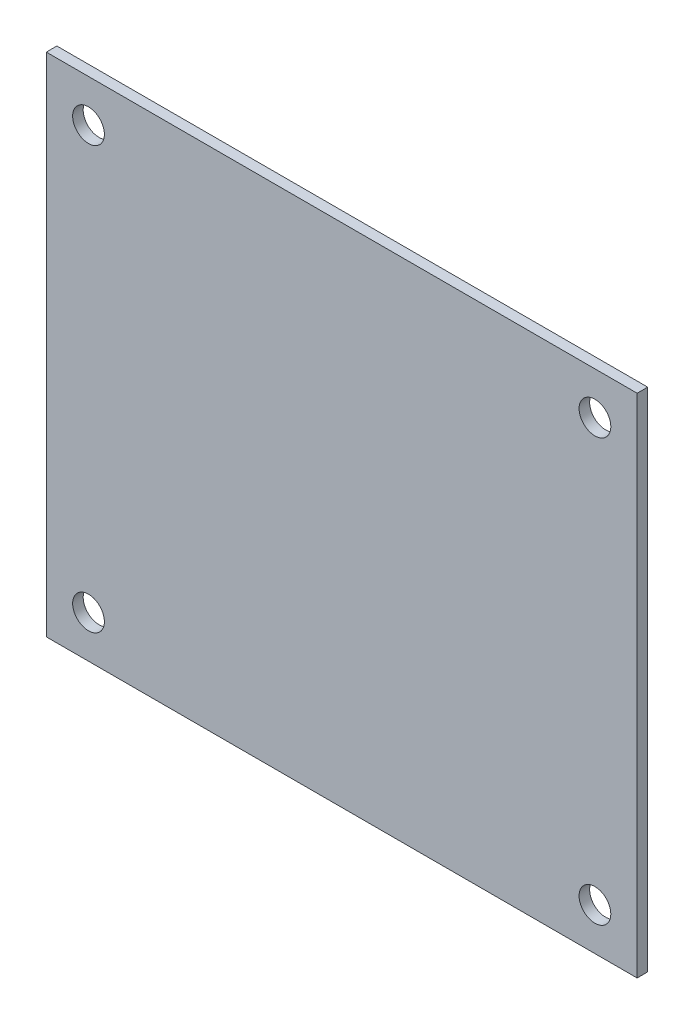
from build123d import *

# Parameters (mm, degrees)
SKETCH1_W           = 88.9
SKETCH1_H           = 76.2
SKETCH1_R           = 2.3876
BOSS_EXTRUDE1_DEPTH = 1.5875
CUT_EXTRUDE1_DEPTH  = 0.127


with BuildPart() as part:
    # Sketch1 → Boss-Extrude1 (new body)
    with BuildSketch(Plane.XY):
        Rectangle(SKETCH1_W, SKETCH1_H)
        with Locations((-38.1, 31.75)):
            Circle(SKETCH1_R, mode=Mode.SUBTRACT)
        with Locations((-38.1, -31.75)):
            Circle(SKETCH1_R, mode=Mode.SUBTRACT)
        with Locations((38.1, -31.75)):
            Circle(SKETCH1_R, mode=Mode.SUBTRACT)
        with Locations((38.1, 31.75)):
            Circle(SKETCH1_R, mode=Mode.SUBTRACT)
    extrude(amount=BOSS_EXTRUDE1_DEPTH)

    # Sketch2 → Cut-Extrude1 (cut)
    # profile 1 of 12: a face of its own
    with BuildSketch(Plane(origin=(0, 0, 0), x_dir=(-1, 0, 0), z_dir=(0, 0, -1))):
        with BuildLine():
            Line((18.503368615, -23.41424052), (18.503368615, -26.58924052))
            Line((18.503368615, -26.58924052), (17.862262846, -26.58924052))
            add(Edge.make_bspline(
                [(17.862262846, -26.58924052), (17.806501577, -26.588840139), (17.698771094, -26.588066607), (17.543095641, -26.583133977), (17.399261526, -26.574496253), (17.267350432, -26.561671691), (17.147150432, -26.546278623), (17.038854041, -26.526702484), (16.942285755, -26.503679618), (16.882895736, -26.484043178), (16.854810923, -26.474757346)],
                knots=[0, 0, 0, 0, 1.314317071, 2.539253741, 3.67075822, 4.709970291, 5.662644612, 6.526156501, 7.303037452, 8, 8, 8, 8], degree=3))
            add(Edge.make_bspline(
                [(16.854810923, -26.474757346), (16.818073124, -26.460763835), (16.745430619, -26.43309414), (16.642057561, -26.380819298), (16.544413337, -26.321831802), (16.453268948, -26.25477927), (16.368423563, -26.180518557), (16.288809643, -26.099650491), (16.216709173, -26.010016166), (16.149635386, -25.914396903), (16.09092842, -25.811922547), (16.039160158, -25.704645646), (15.994957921, -25.592774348), (15.960468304, -25.475492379), (15.931973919, -25.353926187), (15.912854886, -25.227155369), (15.900154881, -25.095919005), (15.898884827, -25.006859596), (15.89824041, -24.961671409)],
                knots=[0, 0, 0, 0, 0.984696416, 1.947063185, 2.89840987, 3.841051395, 4.778753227, 5.721858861, 6.681155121, 7.65838316, 8.646299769, 9.637283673, 10.641736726, 11.657050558, 12.698485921, 13.768600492, 14.86780186, 16, 16, 16, 16], degree=3))
            add(Edge.make_bspline(
                [(15.89824041, -24.961671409), (15.898811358, -24.922427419), (15.899936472, -24.845093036), (15.910026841, -24.731116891), (15.924721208, -24.620530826), (15.947366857, -24.513820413), (15.975193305, -24.410267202), (16.009538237, -24.310361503), (16.050245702, -24.214035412), (16.097454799, -24.122054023), (16.149146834, -24.034640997), (16.205473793, -23.953181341), (16.264507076, -23.876776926), (16.328399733, -23.807153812), (16.395036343, -23.742143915), (16.466683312, -23.684631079), (16.541097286, -23.631945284), (16.620513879, -23.585686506), (16.705584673, -23.544537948), (16.798531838, -23.509787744), (16.899016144, -23.479882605), (17.007703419, -23.456056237), (17.124231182, -23.436850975), (17.248915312, -23.424061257), (17.38152233, -23.415388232), (17.472580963, -23.414630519), (17.519449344, -23.41424052)],
                knots=[0, 0, 0, 0, 1.105894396, 2.179280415, 3.222964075, 4.248423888, 5.251546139, 6.243661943, 7.223682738, 8.196462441, 9.155694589, 10.083899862, 10.986397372, 11.874737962, 12.745335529, 13.607670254, 14.461432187, 15.313100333, 16.195087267, 17.121790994, 18.106827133, 19.14775296, 20.255889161, 21.433815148, 22.679170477, 24, 24, 24, 24], degree=3))
            Line((17.519449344, -23.41424052), (18.503368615, -23.41424052))
        make_face()
        with BuildLine():
            Line((18.218432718, -23.739881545), (17.853994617, -23.739881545))
            add(Edge.make_bspline(
                [(17.853994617, -23.739881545), (17.801626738, -23.740106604), (17.700904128, -23.740539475), (17.556071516, -23.744337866), (17.423738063, -23.750544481), (17.30388498, -23.759230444), (17.196579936, -23.770722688), (17.101598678, -23.783535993), (17.01925255, -23.799499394), (16.969423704, -23.813969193), (16.946397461, -23.820655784)],
                knots=[0, 0, 0, 0, 1.375205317, 2.645023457, 3.804390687, 4.853969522, 5.800190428, 6.637939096, 7.370582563, 8, 8, 8, 8], degree=3))
            add(Edge.make_bspline(
                [(16.946397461, -23.820655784), (16.917415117, -23.830861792), (16.860142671, -23.851030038), (16.777709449, -23.887832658), (16.700789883, -23.931372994), (16.628101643, -23.980057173), (16.560111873, -24.034636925), (16.497135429, -24.095285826), (16.438674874, -24.161301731), (16.385666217, -24.232907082), (16.337724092, -24.309307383), (16.296302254, -24.390417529), (16.261384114, -24.475782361), (16.232736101, -24.565104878), (16.210400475, -24.658438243), (16.194675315, -24.756016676), (16.184930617, -24.857801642), (16.183767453, -24.927092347), (16.183176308, -24.962307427)],
                knots=[0, 0, 0, 0, 0.998420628, 1.972994, 2.929372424, 3.86770908, 4.81360496, 5.759023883, 6.706048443, 7.676227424, 8.651287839, 9.634325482, 10.632389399, 11.645655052, 12.680158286, 13.74837235, 14.855672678, 16, 16, 16, 16], degree=3))
            add(Edge.make_bspline(
                [(16.183176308, -24.962307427), (16.183642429, -24.999439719), (16.184558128, -25.072386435), (16.196048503, -25.179424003), (16.212875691, -25.282355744), (16.23708029, -25.381255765), (16.268350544, -25.475995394), (16.305767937, -25.56710987), (16.351198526, -25.653426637), (16.402630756, -25.735676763), (16.460372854, -25.812614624), (16.524168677, -25.88333885), (16.593345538, -25.947981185), (16.667584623, -26.006644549), (16.747923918, -26.058285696), (16.833003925, -26.104224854), (16.924023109, -26.143257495), (16.98735439, -26.164010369), (17.019539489, -26.174557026)],
                knots=[0, 0, 0, 0, 1.122272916, 2.204715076, 3.251197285, 4.274229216, 5.279697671, 6.265416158, 7.248880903, 8.225321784, 9.195852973, 10.153576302, 11.101466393, 12.055578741, 13.010401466, 13.985536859, 14.976245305, 16, 16, 16, 16], degree=3))
            add(Edge.make_bspline(
                [(17.019539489, -26.174557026), (17.046165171, -26.181919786), (17.102778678, -26.197575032), (17.195161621, -26.214652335), (17.299133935, -26.229714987), (17.415157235, -26.242467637), (17.543099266, -26.251618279), (17.683058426, -26.258486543), (17.83509521, -26.263118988), (17.940489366, -26.263435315), (17.99519053, -26.263599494)],
                knots=[0, 0, 0, 0, 0.674548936, 1.434276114, 2.292660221, 3.240891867, 4.284742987, 5.42552168, 6.663806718, 8, 8, 8, 8], degree=3))
            Line((17.99519053, -26.263599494), (18.218432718, -26.263599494))
            Line((18.218432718, -26.263599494), (18.218432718, -23.739881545))
        make_face(mode=Mode.SUBTRACT)
    # profile 2 of 12: a face of its own
    with BuildSketch(Plane(origin=(0, 0, 0), x_dir=(-1, 0, 0), z_dir=(0, 0, -1))):
        with BuildLine():
            Line((12.316189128, -26.006648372), (12.565508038, -25.815843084))
            add(Edge.make_bspline(
                [(12.565508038, -25.815843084), (12.583293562, -25.837039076), (12.618624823, -25.879145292), (12.675462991, -25.938276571), (12.734710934, -25.993656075), (12.796286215, -26.045639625), (12.861613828, -26.092137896), (12.928204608, -26.136772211), (12.998478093, -26.17585109), (13.09515944, -26.223590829), (13.222128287, -26.272321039), (13.381408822, -26.314233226), (13.547911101, -26.340662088), (13.661478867, -26.343543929), (13.719244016, -26.34500975)],
                knots=[0, 0, 0, 0, 0.75789156, 1.505565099, 2.245254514, 2.979266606, 3.711207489, 4.440978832, 5.174393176, 5.91211879, 7.394186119, 8.890401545, 10.418332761, 12, 12, 12, 12], degree=3))
            add(Edge.make_bspline(
                [(13.719244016, -26.34500975), (13.751069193, -26.344641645), (13.814424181, -26.343908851), (13.908453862, -26.334309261), (14.00090581, -26.320661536), (14.091436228, -26.30090362), (14.179865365, -26.275180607), (14.266866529, -26.245014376), (14.351415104, -26.207475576), (14.434528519, -26.16601893), (14.514153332, -26.119180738), (14.58950711, -26.068107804), (14.66025, -26.013304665), (14.726561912, -25.954900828), (14.787774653, -25.892214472), (14.844538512, -25.825949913), (14.896781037, -25.755807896), (14.944448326, -25.682123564), (14.987083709, -25.605260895), (15.024055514, -25.525550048), (15.055307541, -25.443295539), (15.080661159, -25.35867365), (15.100503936, -25.271983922), (15.114239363, -25.182915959), (15.123750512, -25.091625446), (15.124476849, -25.029750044), (15.124842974, -24.998560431)],
                knots=[0, 0, 0, 0, 1.054960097, 2.100129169, 3.131228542, 4.15308236, 5.169990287, 6.183953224, 7.204064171, 8.235355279, 9.262684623, 10.264978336, 11.252191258, 12.228402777, 13.192898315, 14.155264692, 15.119862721, 16.091023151, 17.063429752, 18.032246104, 19.00241354, 19.978852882, 20.959535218, 21.948948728, 22.966123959, 24, 24, 24, 24], degree=3))
            add(Edge.make_bspline(
                [(15.124842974, -24.998560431), (15.12369564, -24.95163378), (15.121443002, -24.859499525), (15.101480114, -24.724528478), (15.070900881, -24.595101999), (15.025821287, -24.472096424), (14.969126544, -24.354486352), (14.898387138, -24.243698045), (14.816148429, -24.138108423), (14.721566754, -24.040274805), (14.61778159, -23.950910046), (14.506432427, -23.872214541), (14.387792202, -23.806614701), (14.263172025, -23.752026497), (14.131612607, -23.710065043), (13.993350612, -23.680524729), (13.848686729, -23.661255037), (13.749835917, -23.659410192), (13.699527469, -23.658471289)],
                knots=[0, 0, 0, 0, 1.029159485, 2.020618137, 2.987588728, 3.942669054, 4.889339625, 5.846988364, 6.821327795, 7.821533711, 8.827683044, 9.822769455, 10.807800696, 11.797391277, 12.803701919, 13.832062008, 14.896664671, 16, 16, 16, 16], degree=3))
            add(Edge.make_bspline(
                [(13.699527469, -23.658471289), (13.644098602, -23.660003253), (13.53500133, -23.663018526), (13.375010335, -23.688562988), (13.221852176, -23.729981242), (13.075518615, -23.787945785), (12.936422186, -23.863297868), (12.804345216, -23.954645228), (12.67917622, -24.062856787), (12.603909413, -24.145482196), (12.565508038, -24.187637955)],
                knots=[0, 0, 0, 0, 1.028121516, 2.023589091, 2.998037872, 3.967518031, 4.937445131, 5.927275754, 6.942489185, 8, 8, 8, 8], degree=3))
            Line((12.565508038, -24.187637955), (12.316189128, -23.99874072))
            add(Edge.make_bspline(
                [(12.316189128, -23.99874072), (12.33625409, -23.972853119), (12.376287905, -23.921201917), (12.441100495, -23.848371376), (12.509425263, -23.779925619), (12.581446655, -23.716221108), (12.65725869, -23.656939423), (12.736828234, -23.602356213), (12.819758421, -23.551865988), (12.906153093, -23.50610253), (12.99601698, -23.465380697), (13.088579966, -23.429789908), (13.184011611, -23.399904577), (13.281559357, -23.374794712), (13.382225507, -23.356861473), (13.484858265, -23.342589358), (13.590413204, -23.334120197), (13.661563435, -23.333264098), (13.697619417, -23.332830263)],
                knots=[0, 0, 0, 0, 0.986880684, 1.969034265, 2.935876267, 3.899990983, 4.864973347, 5.834408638, 6.8063673, 7.789580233, 8.778939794, 9.778051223, 10.776304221, 11.791326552, 12.811423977, 13.855999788, 14.91350973, 16, 16, 16, 16], degree=3))
            add(Edge.make_bspline(
                [(13.697619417, -23.332830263), (13.7317676, -23.333067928), (13.799291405, -23.33353788), (13.898985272, -23.341150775), (13.996040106, -23.351537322), (14.090178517, -23.367176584), (14.181914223, -23.385631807), (14.27041561, -23.410370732), (14.356553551, -23.43808319), (14.439981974, -23.470654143), (14.520771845, -23.507408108), (14.598662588, -23.548947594), (14.67361838, -23.594923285), (14.746376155, -23.644321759), (14.815861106, -23.69872974), (14.882675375, -23.757391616), (14.947193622, -23.820109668), (14.987110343, -23.865335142), (15.007179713, -23.888073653)],
                knots=[0, 0, 0, 0, 1.114604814, 2.203992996, 3.262667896, 4.300477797, 5.318619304, 6.316056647, 7.298880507, 8.271930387, 9.238335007, 10.195173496, 11.151986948, 12.108099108, 13.064862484, 14.031167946, 15.010108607, 16, 16, 16, 16], degree=3))
            add(Edge.make_bspline(
                [(15.007179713, -23.888073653), (15.039322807, -23.927572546), (15.103220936, -24.006093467), (15.185008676, -24.133340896), (15.254785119, -24.266079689), (15.31183172, -24.405078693), (15.355650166, -24.550391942), (15.386457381, -24.701785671), (15.40633723, -24.858957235), (15.408619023, -24.96585053), (15.409778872, -25.020185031)],
                knots=[0, 0, 0, 0, 0.994611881, 1.977215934, 2.950189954, 3.921972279, 4.908960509, 5.911694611, 6.938501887, 8, 8, 8, 8], degree=3))
            add(Edge.make_bspline(
                [(15.409778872, -25.020185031), (15.408361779, -25.077292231), (15.405573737, -25.189647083), (15.382081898, -25.354576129), (15.343832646, -25.512362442), (15.291163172, -25.663613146), (15.221678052, -25.807462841), (15.137560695, -25.944519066), (15.037989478, -26.074669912), (14.92421492, -26.196251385), (14.79941512, -26.307409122), (14.665777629, -26.405205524), (14.523553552, -26.486591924), (14.37431248, -26.554624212), (14.21693615, -26.60691596), (14.051760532, -26.643522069), (13.879095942, -26.66630688), (13.761292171, -26.669187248), (13.701435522, -26.670650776)],
                knots=[0, 0, 0, 0, 1.032901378, 2.032168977, 3.007206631, 3.966850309, 4.924221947, 5.891988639, 6.871730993, 7.884084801, 8.900290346, 9.89161143, 10.874607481, 11.860025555, 12.854717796, 13.869097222, 14.917278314, 16, 16, 16, 16], degree=3))
            add(Edge.make_bspline(
                [(13.701435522, -26.670650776), (13.6649553, -26.670213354), (13.592746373, -26.669347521), (13.485927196, -26.6609063), (13.381932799, -26.64683038), (13.280473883, -26.62764724), (13.181383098, -26.603787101), (13.085105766, -26.573911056), (12.991917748, -26.537788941), (12.901190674, -26.497585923), (12.81408782, -26.451542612), (12.730652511, -26.401495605), (12.651562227, -26.346481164), (12.576302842, -26.287301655), (12.505222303, -26.223501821), (12.437253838, -26.156154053), (12.37441558, -26.083471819), (12.335633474, -26.032303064), (12.316189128, -26.006648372)],
                knots=[0, 0, 0, 0, 1.096566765, 2.170543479, 3.218870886, 4.250164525, 5.273529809, 6.281496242, 7.278154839, 8.276706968, 9.263143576, 10.238168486, 11.199979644, 12.157579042, 13.114563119, 14.070017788, 15.032356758, 16, 16, 16, 16], degree=3))
        make_face()
    # profile 3 of 12: a face of its own
    with BuildSketch(Plane(origin=(0, 0, 0), x_dir=(-1, 0, 0), z_dir=(0, 0, -1))):
        Polygon((11.275028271, -26.58924052), (10.687984, -26.58924052), (10.687984, -23.41424052), (10.972919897, -23.41424052), (10.972919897, -26.263599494), (11.461381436, -26.263599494), align=None)
    # profile 4 of 12: a face of its own
    with BuildSketch(Plane(origin=(0, 0, 0), x_dir=(-1, 0, 0), z_dir=(0, 0, -1))):
        with BuildLine():
            Line((8.815548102, -23.332830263), (9.043242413, -23.491198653))
            Line((9.043242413, -23.491198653), (8.160449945, -24.78167842))
            add(Edge.make_bspline(
                [(8.160449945, -24.78167842), (8.216767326, -24.774469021), (8.327629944, -24.760277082), (8.439378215, -24.758422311), (8.4943592, -24.75750975)],
                knots=[0, 0, 0, 0, 1.015985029, 2, 2, 2, 2], degree=3))
            add(Edge.make_bspline(
                [(8.4943592, -24.75750975), (8.527688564, -24.758365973), (8.593111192, -24.760046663), (8.689310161, -24.773292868), (8.781882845, -24.793925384), (8.870476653, -24.823998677), (8.955012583, -24.862433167), (9.035785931, -24.909251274), (9.112688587, -24.964627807), (9.184820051, -25.02796547), (9.250405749, -25.097530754), (9.308884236, -25.17113261), (9.357219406, -25.249569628), (9.398088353, -25.331186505), (9.42821355, -25.417725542), (9.450680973, -25.507718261), (9.464361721, -25.601723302), (9.465998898, -25.665697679), (9.466830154, -25.698179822)],
                knots=[0, 0, 0, 0, 1.060682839, 2.082027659, 3.085691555, 4.076014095, 5.054630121, 6.037449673, 7.043289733, 8.066773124, 9.088474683, 10.083546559, 11.053653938, 12.01652662, 12.983553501, 13.964076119, 14.966286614, 16, 16, 16, 16], degree=3))
            add(Edge.make_bspline(
                [(9.466830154, -25.698179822), (9.465253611, -25.742599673), (9.462159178, -25.82978683), (9.437349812, -25.957204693), (9.39624527, -26.077750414), (9.339831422, -26.191289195), (9.267414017, -26.295213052), (9.181412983, -26.389169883), (9.081133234, -26.471483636), (8.96919291, -26.542159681), (8.848382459, -26.599388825), (8.721331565, -26.640047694), (8.59018048, -26.666021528), (8.501051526, -26.669101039), (8.456198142, -26.670650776)],
                knots=[0, 0, 0, 0, 1.023011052, 2.007963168, 2.978169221, 3.950402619, 4.919353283, 5.887490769, 6.876420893, 7.899700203, 8.931203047, 9.947778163, 10.96723692, 12, 12, 12, 12], degree=3))
            add(Edge.make_bspline(
                [(8.456198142, -26.670650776), (8.412210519, -26.668996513), (8.325295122, -26.665727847), (8.197314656, -26.641579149), (8.074629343, -26.601312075), (7.958199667, -26.54541241), (7.850969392, -26.474880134), (7.754123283, -26.391561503), (7.670615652, -26.294499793), (7.59939481, -26.186668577), (7.543295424, -26.070084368), (7.50218725, -25.948626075), (7.477059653, -25.823020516), (7.473882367, -25.737938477), (7.472278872, -25.694999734)],
                knots=[0, 0, 0, 0, 1.026310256, 2.027892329, 3.027798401, 4.032590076, 5.033095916, 6.015299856, 7.004484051, 8.011843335, 9.023241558, 10.015317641, 10.998381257, 12, 12, 12, 12], degree=3))
            add(Edge.make_bspline(
                [(7.472278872, -25.694999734), (7.473339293, -25.661666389), (7.475490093, -25.594058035), (7.490769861, -25.491619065), (7.515907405, -25.387033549), (7.544613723, -25.298316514), (7.574450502, -25.225559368), (7.599371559, -25.167004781), (7.629759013, -25.106315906), (7.664341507, -25.043053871), (7.701416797, -24.976297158), (7.743211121, -24.90728736), (7.788842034, -24.835634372), (7.821345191, -24.787331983), (7.837989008, -24.762597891)],
                knots=[0, 0, 0, 0, 1.179744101, 2.39281581, 3.657884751, 4.98449437, 5.688244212, 6.441097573, 7.23650985, 8.089392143, 8.993247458, 9.939208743, 10.944735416, 12, 12, 12, 12], degree=3))
            Line((7.837989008, -24.762597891), (8.815548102, -23.332830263))
        make_face()
        with BuildLine():
            add(Edge.make_bspline(
                [(8.441569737, -25.083150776), (8.416320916, -25.083841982), (8.367170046, -25.085187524), (8.295155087, -25.093340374), (8.227218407, -25.107902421), (8.16292276, -25.128466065), (8.102345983, -25.154516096), (8.045468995, -25.186262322), (7.992872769, -25.224400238), (7.944370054, -25.267268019), (7.900352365, -25.314249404), (7.862398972, -25.364585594), (7.829538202, -25.41671282), (7.803322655, -25.4716982), (7.782195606, -25.528642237), (7.767453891, -25.588368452), (7.759311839, -25.650464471), (7.757921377, -25.692644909), (7.757214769, -25.714080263)],
                knots=[0, 0, 0, 0, 1.163726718, 2.265380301, 3.334713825, 4.36057981, 5.371541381, 6.368955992, 7.355979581, 8.359691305, 9.348261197, 10.317521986, 11.261029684, 12.183096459, 13.119698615, 14.055740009, 15.011961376, 16, 16, 16, 16], degree=3))
            add(Edge.make_bspline(
                [(7.757214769, -25.714080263), (7.757821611, -25.735525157), (7.759017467, -25.777784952), (7.768630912, -25.839964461), (7.785492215, -25.899575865), (7.808359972, -25.957009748), (7.837857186, -26.012009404), (7.873730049, -26.064415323), (7.916210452, -26.114420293), (7.96461487, -26.161397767), (8.017730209, -26.204565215), (8.074508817, -26.242027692), (8.133705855, -26.274228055), (8.195994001, -26.299437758), (8.2605279, -26.320131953), (8.328017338, -26.334771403), (8.398544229, -26.342929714), (8.446425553, -26.344307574), (8.470826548, -26.34500975)],
                knots=[0, 0, 0, 0, 0.97180342, 1.915057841, 2.843062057, 3.774592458, 4.711855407, 5.666109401, 6.64802866, 7.681008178, 8.719604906, 9.745767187, 10.760480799, 11.768803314, 12.78696958, 13.829338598, 14.893800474, 16, 16, 16, 16], degree=3))
            add(Edge.make_bspline(
                [(8.470826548, -26.34500975), (8.495015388, -26.34430655), (8.542473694, -26.342926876), (8.612372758, -26.334785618), (8.679408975, -26.320037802), (8.743743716, -26.299427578), (8.805900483, -26.274368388), (8.864626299, -26.242028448), (8.9208133, -26.204365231), (8.973913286, -26.16145337), (9.022211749, -26.114194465), (9.065428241, -26.064638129), (9.101218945, -26.011981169), (9.130757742, -25.957017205), (9.153614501, -25.899573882), (9.170478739, -25.839964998), (9.180091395, -25.777784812), (9.18128736, -25.73552511), (9.181894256, -25.714080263)],
                knots=[0, 0, 0, 0, 1.099260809, 2.156740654, 3.192227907, 4.212865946, 5.223636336, 6.232338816, 7.252976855, 8.294094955, 9.329582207, 10.320135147, 11.276705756, 12.216244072, 13.150035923, 14.080293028, 15.025837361, 16, 16, 16, 16], degree=3))
            add(Edge.make_bspline(
                [(9.181894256, -25.714080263), (9.181343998, -25.69262828), (9.180258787, -25.650321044), (9.169810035, -25.588153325), (9.152289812, -25.528581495), (9.129057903, -25.471097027), (9.097880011, -25.416443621), (9.059989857, -25.364337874), (9.016271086, -25.313714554), (8.965290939, -25.267414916), (8.910547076, -25.224195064), (8.851746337, -25.186502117), (8.790070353, -25.154895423), (8.725915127, -25.128389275), (8.658800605, -25.108109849), (8.588820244, -25.093367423), (8.515961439, -25.085265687), (8.466604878, -25.08386251), (8.441569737, -25.083150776)],
                knots=[0, 0, 0, 0, 0.952872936, 1.879239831, 2.791748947, 3.708674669, 4.628500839, 5.580394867, 6.568761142, 7.595635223, 8.636123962, 9.665976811, 10.694276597, 11.712685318, 12.747011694, 13.805940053, 14.887106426, 16, 16, 16, 16], degree=3))
        make_face(mode=Mode.SUBTRACT)
    # profile 5 of 12: a face of its own
    with BuildSketch(Plane(origin=(0, 0, 0), x_dir=(-1, 0, 0), z_dir=(0, 0, -1))):
        Polygon((5.332079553, -26.670650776), (5.274201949, -26.670650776), (5.274201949, -24.472573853), (4.907855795, -24.472573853), (4.907855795, -24.146932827), (5.274201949, -24.146932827), (5.274201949, -23.41424052), (5.559137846, -23.41424052), (5.559137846, -24.146932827), (7.06522759, -24.146932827), align=None)
        Polygon((5.559137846, -24.472573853), (5.559137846, -25.851460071), (6.505532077, -24.472573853), align=None, mode=Mode.SUBTRACT)
    # profile 6 of 12: a face of its own
    with BuildSketch(Plane(origin=(0, 0, 0), x_dir=(-1, 0, 0), z_dir=(0, 0, -1))):
        with BuildLine():
            add(Edge.make_bspline(
                [(4.622919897, -25.000468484), (4.622622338, -25.051356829), (4.622044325, -25.150208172), (4.615614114, -25.294248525), (4.604932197, -25.429376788), (4.590293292, -25.555599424), (4.572478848, -25.672949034), (4.548697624, -25.781111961), (4.521653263, -25.880588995), (4.490308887, -25.971703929), (4.454942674, -26.055686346), (4.416444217, -26.134082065), (4.373312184, -26.206797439), (4.327918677, -26.274903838), (4.278675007, -26.337715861), (4.225752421, -26.39495122), (4.169617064, -26.447496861), (4.110003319, -26.494488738), (4.04747938, -26.53543589), (3.983894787, -26.572553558), (3.917435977, -26.601914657), (3.849742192, -26.627021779), (3.780268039, -26.646910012), (3.708983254, -26.660743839), (3.635823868, -26.669398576), (3.58644762, -26.670229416), (3.561406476, -26.670650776)],
                knots=[0, 0, 0, 0, 1.64625301, 3.197870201, 4.6634513, 6.030635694, 7.308242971, 8.501545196, 9.611429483, 10.641742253, 11.616230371, 12.55791849, 13.464870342, 14.34944951, 15.20427819, 16.044004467, 16.869007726, 17.689551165, 18.496129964, 19.285613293, 20.0683943, 20.843080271, 21.620342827, 22.403213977, 23.190190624, 24, 24, 24, 24], degree=3))
            add(Edge.make_bspline(
                [(3.561406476, -26.670650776), (3.536143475, -26.670300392), (3.485878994, -26.669603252), (3.411833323, -26.65979058), (3.339077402, -26.64712508), (3.268715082, -26.626811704), (3.199415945, -26.602504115), (3.132903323, -26.570430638), (3.066828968, -26.535548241), (3.00419455, -26.492994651), (2.943128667, -26.445965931), (2.885885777, -26.392576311), (2.831002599, -26.334303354), (2.78055205, -26.269847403), (2.732371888, -26.20019676), (2.688291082, -26.12476755), (2.647392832, -26.043726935), (2.608908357, -25.957450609), (2.575254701, -25.863633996), (2.54533391, -25.762862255), (2.520808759, -25.654222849), (2.500526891, -25.53832097), (2.4847843, -25.41458244), (2.473327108, -25.283257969), (2.467272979, -25.144265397), (2.466133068, -25.049235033), (2.465548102, -25.000468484)],
                knots=[0, 0, 0, 0, 0.810910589, 1.61342667, 2.396193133, 3.181089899, 3.963115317, 4.752255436, 5.550715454, 6.36105385, 7.181178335, 8.024612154, 8.872680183, 9.750181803, 10.651284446, 11.591556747, 12.554036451, 13.566402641, 14.62422919, 15.753422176, 16.94128843, 18.199818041, 19.531985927, 20.947085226, 22.433341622, 24, 24, 24, 24], degree=3))
            add(Edge.make_bspline(
                [(2.465548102, -25.000468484), (2.466146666, -24.951915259), (2.467315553, -24.857099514), (2.473189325, -24.718723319), (2.485091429, -24.588115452), (2.499597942, -24.465086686), (2.520513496, -24.34979784), (2.543798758, -24.241629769), (2.573500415, -24.141598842), (2.606355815, -24.048586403), (2.644304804, -23.962675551), (2.684895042, -23.881969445), (2.729633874, -23.806968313), (2.776889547, -23.736876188), (2.828295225, -23.672973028), (2.88243567, -23.614048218), (2.940233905, -23.56056584), (3.00161414, -23.512981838), (3.064840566, -23.470107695), (3.130927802, -23.433981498), (3.198328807, -23.402486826), (3.267744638, -23.377168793), (3.338732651, -23.357154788), (3.411548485, -23.343530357), (3.485888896, -23.33392685), (3.536146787, -23.333197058), (3.561406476, -23.332830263)],
                knots=[0, 0, 0, 0, 1.561431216, 3.049195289, 4.452146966, 5.778046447, 7.031138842, 8.218704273, 9.334037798, 10.384210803, 11.388620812, 12.352076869, 13.287433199, 14.19507451, 15.06813243, 15.922055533, 16.766344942, 17.596869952, 18.417486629, 19.220035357, 20.016159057, 20.807716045, 21.59340902, 22.384936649, 23.188266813, 24, 24, 24, 24], degree=3))
            add(Edge.make_bspline(
                [(3.561406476, -23.332830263), (3.586446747, -23.333255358), (3.635821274, -23.334093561), (3.708993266, -23.342694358), (3.780174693, -23.356719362), (3.849507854, -23.375765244), (3.917134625, -23.399971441), (3.9823926, -23.430760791), (4.046143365, -23.466471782), (4.10809696, -23.507099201), (4.167069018, -23.55365914), (4.223411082, -23.605145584), (4.275648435, -23.662885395), (4.324552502, -23.725957), (4.370322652, -23.794234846), (4.413272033, -23.867506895), (4.451653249, -23.946666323), (4.487821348, -24.031104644), (4.519703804, -24.122889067), (4.547542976, -24.222706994), (4.571013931, -24.331239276), (4.589708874, -24.448491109), (4.605024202, -24.574280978), (4.615603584, -24.708809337), (4.62204111, -24.851788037), (4.622621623, -24.950003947), (4.622919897, -25.000468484)],
                knots=[0, 0, 0, 0, 0.810976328, 1.599087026, 2.383086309, 3.159618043, 3.926613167, 4.707144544, 5.494386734, 6.292609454, 7.104690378, 7.92621526, 8.762510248, 9.62398222, 10.509836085, 11.424023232, 12.373226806, 13.358118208, 14.398657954, 15.5185989, 16.713620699, 17.994156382, 19.364120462, 20.818119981, 22.365111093, 24, 24, 24, 24], degree=3))
        make_face()
        with BuildLine():
            add(Edge.make_bspline(
                [(4.337984, -25.00174052), (4.337873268, -24.959332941), (4.33765836, -24.877028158), (4.332206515, -24.757636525), (4.324618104, -24.646092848), (4.315071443, -24.542440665), (4.300773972, -24.447042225), (4.28455258, -24.359500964), (4.265096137, -24.279978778), (4.241961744, -24.207781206), (4.21561081, -24.141884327), (4.186885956, -24.080537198), (4.155770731, -24.022993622), (4.121551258, -23.969461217), (4.083737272, -23.920238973), (4.043172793, -23.875093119), (3.999621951, -23.834207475), (3.939347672, -23.785684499), (3.860161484, -23.734951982), (3.759880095, -23.691317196), (3.656791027, -23.663718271), (3.586800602, -23.660218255), (3.551866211, -23.658471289)],
                knots=[0, 0, 0, 0, 1.459193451, 2.832007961, 4.111736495, 5.306635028, 6.412683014, 7.430020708, 8.369596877, 9.227877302, 10.036669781, 10.810175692, 11.557788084, 12.286326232, 12.994037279, 13.69140682, 14.37267704, 15.047194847, 16.352618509, 17.594157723, 18.799169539, 20, 20, 20, 20], degree=3))
            add(Edge.make_bspline(
                [(3.551866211, -23.658471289), (3.516731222, -23.660003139), (3.446585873, -23.663061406), (3.343566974, -23.689752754), (3.244383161, -23.73314441), (3.166108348, -23.782718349), (3.106723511, -23.830231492), (3.064159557, -23.870694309), (3.025097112, -23.91601393), (2.988047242, -23.964907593), (2.954066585, -24.018313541), (2.923166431, -24.075973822), (2.8949694, -24.138048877), (2.878904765, -24.181382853), (2.870691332, -24.203538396)],
                knots=[0, 0, 0, 0, 1.353621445, 2.702441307, 4.075953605, 5.516772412, 6.261413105, 7.007624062, 7.778524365, 8.566925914, 9.372323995, 10.217594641, 11.088702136, 12, 12, 12, 12], degree=3))
            add(Edge.make_bspline(
                [(2.870691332, -24.203538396), (2.861119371, -24.231868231), (2.841684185, -24.289389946), (2.816636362, -24.37861983), (2.796910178, -24.47223948), (2.779163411, -24.569689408), (2.767050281, -24.671688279), (2.757300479, -24.777920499), (2.751557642, -24.888466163), (2.75084576, -24.963573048), (2.750484, -25.00174052)],
                knots=[0, 0, 0, 0, 0.884706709, 1.796334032, 2.740027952, 3.714592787, 4.726048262, 5.777819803, 6.87074269, 8, 8, 8, 8], degree=3))
            add(Edge.make_bspline(
                [(2.750484, -25.00174052), (2.750882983, -25.03990717), (2.751663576, -25.114578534), (2.756792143, -25.223822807), (2.765033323, -25.327762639), (2.776187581, -25.42649232), (2.791500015, -25.519836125), (2.809888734, -25.607927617), (2.831447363, -25.69074309), (2.85617587, -25.768495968), (2.884044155, -25.840907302), (2.914831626, -25.908132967), (2.947681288, -25.970535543), (2.983384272, -26.027914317), (3.021435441, -26.080604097), (3.063201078, -26.127391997), (3.106028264, -26.170554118), (3.166937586, -26.218942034), (3.246030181, -26.268668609), (3.345126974, -26.313185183), (3.447687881, -26.339531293), (3.51716514, -26.343184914), (3.551866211, -26.34500975)],
                knots=[0, 0, 0, 0, 1.313528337, 2.569860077, 3.762944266, 4.901481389, 5.988248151, 7.017139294, 7.997571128, 8.932104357, 9.823695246, 10.66607014, 11.475539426, 12.248954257, 12.990316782, 13.708962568, 14.405488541, 15.08007697, 16.381737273, 17.610043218, 18.806313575, 20, 20, 20, 20], degree=3))
            add(Edge.make_bspline(
                [(3.551866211, -26.34500975), (3.586989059, -26.343182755), (3.657298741, -26.339525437), (3.760932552, -26.313278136), (3.860622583, -26.268985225), (3.939548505, -26.218880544), (3.999600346, -26.170742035), (4.04233431, -26.129656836), (4.082664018, -26.08493319), (4.120296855, -26.035934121), (4.154307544, -25.982503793), (4.185800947, -25.925377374), (4.214296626, -25.864121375), (4.240747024, -25.798260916), (4.263635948, -25.72594471), (4.284215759, -25.646438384), (4.300100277, -25.558327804), (4.314204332, -25.462481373), (4.324865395, -25.358705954), (4.332153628, -25.246898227), (4.337674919, -25.127090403), (4.337878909, -25.044360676), (4.337984, -25.00174052)],
                knots=[0, 0, 0, 0, 1.207779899, 2.417760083, 3.652287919, 4.947299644, 5.621638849, 6.297435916, 6.984320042, 7.691843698, 8.42018894, 9.161205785, 9.934506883, 10.743085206, 11.601138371, 12.542248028, 13.566483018, 14.679455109, 15.87477181, 17.154161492, 18.533899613, 20, 20, 20, 20], degree=3))
        make_face(mode=Mode.SUBTRACT)
    # profile 7 of 12: a face of its own
    with BuildSketch(Plane(origin=(0, 0, 0), x_dir=(-1, 0, 0), z_dir=(0, 0, -1))):
        Polygon((0.593112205, -26.58924052), (-0.87227241, -23.41424052), (-0.562531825, -23.41424052), (-0.093150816, -24.431868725), (1.346157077, -24.431868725), (1.828894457, -23.41424052), (2.139907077, -23.41424052), (0.633817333, -26.58924052), align=None)
        Polygon((0.616644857, -25.970395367), (1.191604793, -24.75750975), (0.056949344, -24.75750975), align=None, mode=Mode.SUBTRACT)
    # profile 8 of 12: a face of its own
    with BuildSketch(Plane(origin=(0, 0, 0), x_dir=(-1, 0, 0), z_dir=(0, 0, -1))):
        with BuildLine():
            Line((-2.581887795, -23.41424052), (-2.581887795, -26.58924052))
            Line((-2.581887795, -26.58924052), (-3.222993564, -26.58924052))
            add(Edge.make_bspline(
                [(-3.222993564, -26.58924052), (-3.278754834, -26.588840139), (-3.386485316, -26.588066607), (-3.542160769, -26.583133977), (-3.685994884, -26.574496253), (-3.817905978, -26.561671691), (-3.938105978, -26.546278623), (-4.04640237, -26.526702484), (-4.142970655, -26.503679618), (-4.202360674, -26.484043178), (-4.230445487, -26.474757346)],
                knots=[0, 0, 0, 0, 1.314317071, 2.539253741, 3.67075822, 4.709970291, 5.662644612, 6.526156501, 7.303037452, 8, 8, 8, 8], degree=3))
            add(Edge.make_bspline(
                [(-4.230445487, -26.474757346), (-4.267183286, -26.460763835), (-4.339825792, -26.43309414), (-4.443198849, -26.380819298), (-4.540843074, -26.321831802), (-4.631987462, -26.25477927), (-4.716832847, -26.180518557), (-4.796446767, -26.099650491), (-4.868547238, -26.010016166), (-4.935621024, -25.914396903), (-4.99432799, -25.811922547), (-5.046096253, -25.704645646), (-5.090298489, -25.592774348), (-5.124788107, -25.475492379), (-5.153282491, -25.353926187), (-5.172401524, -25.227155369), (-5.185101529, -25.095919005), (-5.186371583, -25.006859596), (-5.187016, -24.961671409)],
                knots=[0, 0, 0, 0, 0.984696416, 1.947063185, 2.89840987, 3.841051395, 4.778753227, 5.721858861, 6.681155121, 7.65838316, 8.646299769, 9.637283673, 10.641736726, 11.657050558, 12.698485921, 13.768600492, 14.86780186, 16, 16, 16, 16], degree=3))
            add(Edge.make_bspline(
                [(-5.187016, -24.961671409), (-5.186445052, -24.922427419), (-5.185319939, -24.845093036), (-5.175229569, -24.731116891), (-5.160535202, -24.620530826), (-5.137889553, -24.513820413), (-5.110063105, -24.410267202), (-5.075718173, -24.310361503), (-5.035010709, -24.214035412), (-4.987801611, -24.122054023), (-4.936109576, -24.034640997), (-4.879782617, -23.953181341), (-4.820749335, -23.876776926), (-4.756856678, -23.807153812), (-4.690220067, -23.742143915), (-4.618573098, -23.684631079), (-4.544159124, -23.631945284), (-4.464742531, -23.585686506), (-4.379671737, -23.544537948), (-4.286724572, -23.509787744), (-4.186240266, -23.479882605), (-4.077552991, -23.456056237), (-3.961025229, -23.436850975), (-3.836341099, -23.424061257), (-3.70373408, -23.415388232), (-3.612675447, -23.414630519), (-3.565807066, -23.41424052)],
                knots=[0, 0, 0, 0, 1.105894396, 2.179280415, 3.222964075, 4.248423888, 5.251546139, 6.243661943, 7.223682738, 8.196462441, 9.155694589, 10.083899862, 10.986397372, 11.874737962, 12.745335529, 13.607670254, 14.461432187, 15.313100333, 16.195087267, 17.121790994, 18.106827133, 19.14775296, 20.255889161, 21.433815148, 22.679170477, 24, 24, 24, 24], degree=3))
            Line((-3.565807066, -23.41424052), (-2.581887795, -23.41424052))
        make_face()
        with BuildLine():
            Line((-2.866823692, -23.739881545), (-3.231261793, -23.739881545))
            add(Edge.make_bspline(
                [(-3.231261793, -23.739881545), (-3.283629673, -23.740106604), (-3.384352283, -23.740539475), (-3.529184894, -23.744337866), (-3.661518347, -23.750544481), (-3.78137143, -23.759230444), (-3.888676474, -23.770722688), (-3.983657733, -23.783535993), (-4.06600386, -23.799499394), (-4.115832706, -23.813969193), (-4.138858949, -23.820655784)],
                knots=[0, 0, 0, 0, 1.375205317, 2.645023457, 3.804390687, 4.853969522, 5.800190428, 6.637939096, 7.370582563, 8, 8, 8, 8], degree=3))
            add(Edge.make_bspline(
                [(-4.138858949, -23.820655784), (-4.167841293, -23.830861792), (-4.225113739, -23.851030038), (-4.307546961, -23.887832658), (-4.384466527, -23.931372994), (-4.457154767, -23.980057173), (-4.525144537, -24.034636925), (-4.588120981, -24.095285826), (-4.646581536, -24.161301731), (-4.699590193, -24.232907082), (-4.747532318, -24.309307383), (-4.788954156, -24.390417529), (-4.823872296, -24.475782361), (-4.852520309, -24.565104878), (-4.874855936, -24.658438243), (-4.890581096, -24.756016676), (-4.900325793, -24.857801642), (-4.901488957, -24.927092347), (-4.902080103, -24.962307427)],
                knots=[0, 0, 0, 0, 0.998420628, 1.972994, 2.929372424, 3.86770908, 4.81360496, 5.759023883, 6.706048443, 7.676227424, 8.651287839, 9.634325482, 10.632389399, 11.645655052, 12.680158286, 13.74837235, 14.855672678, 16, 16, 16, 16], degree=3))
            add(Edge.make_bspline(
                [(-4.902080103, -24.962307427), (-4.901613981, -24.999439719), (-4.900698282, -25.072386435), (-4.889207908, -25.179424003), (-4.872380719, -25.282355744), (-4.84817612, -25.381255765), (-4.816905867, -25.475995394), (-4.779488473, -25.56710987), (-4.734057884, -25.653426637), (-4.682625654, -25.735676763), (-4.624883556, -25.812614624), (-4.561087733, -25.88333885), (-4.491910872, -25.947981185), (-4.417671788, -26.006644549), (-4.337332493, -26.058285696), (-4.252252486, -26.104224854), (-4.161233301, -26.143257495), (-4.097902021, -26.164010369), (-4.065716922, -26.174557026)],
                knots=[0, 0, 0, 0, 1.122272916, 2.204715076, 3.251197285, 4.274229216, 5.279697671, 6.265416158, 7.248880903, 8.225321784, 9.195852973, 10.153576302, 11.101466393, 12.055578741, 13.010401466, 13.985536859, 14.976245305, 16, 16, 16, 16], degree=3))
            add(Edge.make_bspline(
                [(-4.065716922, -26.174557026), (-4.039091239, -26.181919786), (-3.982477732, -26.197575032), (-3.89009479, -26.214652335), (-3.786122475, -26.229714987), (-3.670099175, -26.242467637), (-3.542157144, -26.251618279), (-3.402197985, -26.258486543), (-3.2501612, -26.263118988), (-3.144767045, -26.263435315), (-3.09006588, -26.263599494)],
                knots=[0, 0, 0, 0, 0.674548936, 1.434276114, 2.292660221, 3.240891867, 4.284742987, 5.42552168, 6.663806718, 8, 8, 8, 8], degree=3))
            Line((-3.09006588, -26.263599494), (-2.866823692, -26.263599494))
            Line((-2.866823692, -26.263599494), (-2.866823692, -23.739881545))
        make_face(mode=Mode.SUBTRACT)
    # profile 9 of 12: a face of its own
    with BuildSketch(Plane(origin=(0, 0, 0), x_dir=(-1, 0, 0), z_dir=(0, 0, -1))):
        with BuildLine():
            Line((-8.769067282, -26.006648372), (-8.519748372, -25.815843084))
            add(Edge.make_bspline(
                [(-8.519748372, -25.815843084), (-8.501962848, -25.837039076), (-8.466631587, -25.879145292), (-8.409793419, -25.938276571), (-8.350545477, -25.993656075), (-8.288970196, -26.045639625), (-8.223642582, -26.092137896), (-8.157051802, -26.136772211), (-8.086778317, -26.17585109), (-7.99009697, -26.223590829), (-7.863128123, -26.272321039), (-7.703847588, -26.314233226), (-7.53734531, -26.340662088), (-7.423777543, -26.343543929), (-7.366012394, -26.34500975)],
                knots=[0, 0, 0, 0, 0.75789156, 1.505565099, 2.245254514, 2.979266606, 3.711207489, 4.440978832, 5.174393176, 5.91211879, 7.394186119, 8.890401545, 10.418332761, 12, 12, 12, 12], degree=3))
            add(Edge.make_bspline(
                [(-7.366012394, -26.34500975), (-7.334187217, -26.344641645), (-7.270832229, -26.343908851), (-7.176802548, -26.334309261), (-7.0843506, -26.320661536), (-6.993820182, -26.30090362), (-6.905391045, -26.275180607), (-6.818389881, -26.245014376), (-6.733841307, -26.207475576), (-6.650727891, -26.16601893), (-6.571103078, -26.119180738), (-6.4957493, -26.068107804), (-6.42500641, -26.013304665), (-6.358694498, -25.954900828), (-6.297481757, -25.892214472), (-6.240717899, -25.825949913), (-6.188475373, -25.755807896), (-6.140808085, -25.682123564), (-6.098172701, -25.605260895), (-6.061200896, -25.525550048), (-6.029948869, -25.443295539), (-6.004595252, -25.35867365), (-5.984752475, -25.271983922), (-5.971017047, -25.182915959), (-5.961505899, -25.091625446), (-5.960779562, -25.029750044), (-5.960413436, -24.998560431)],
                knots=[0, 0, 0, 0, 1.054960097, 2.100129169, 3.131228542, 4.15308236, 5.169990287, 6.183953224, 7.204064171, 8.235355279, 9.262684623, 10.264978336, 11.252191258, 12.228402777, 13.192898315, 14.155264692, 15.119862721, 16.091023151, 17.063429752, 18.032246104, 19.00241354, 19.978852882, 20.959535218, 21.948948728, 22.966123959, 24, 24, 24, 24], degree=3))
            add(Edge.make_bspline(
                [(-5.960413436, -24.998560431), (-5.96156077, -24.95163378), (-5.963813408, -24.859499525), (-5.983776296, -24.724528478), (-6.014355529, -24.595101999), (-6.059435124, -24.472096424), (-6.116129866, -24.354486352), (-6.186869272, -24.243698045), (-6.269107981, -24.138108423), (-6.363689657, -24.040274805), (-6.46747482, -23.950910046), (-6.578823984, -23.872214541), (-6.697464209, -23.806614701), (-6.822084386, -23.752026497), (-6.953643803, -23.710065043), (-7.091905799, -23.680524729), (-7.236569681, -23.661255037), (-7.335420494, -23.659410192), (-7.385728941, -23.658471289)],
                knots=[0, 0, 0, 0, 1.029159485, 2.020618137, 2.987588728, 3.942669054, 4.889339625, 5.846988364, 6.821327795, 7.821533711, 8.827683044, 9.822769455, 10.807800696, 11.797391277, 12.803701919, 13.832062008, 14.896664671, 16, 16, 16, 16], degree=3))
            add(Edge.make_bspline(
                [(-7.385728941, -23.658471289), (-7.441157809, -23.660003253), (-7.55025508, -23.663018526), (-7.710246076, -23.688562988), (-7.863404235, -23.729981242), (-8.009737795, -23.787945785), (-8.148834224, -23.863297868), (-8.280911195, -23.954645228), (-8.406080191, -24.062856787), (-8.481346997, -24.145482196), (-8.519748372, -24.187637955)],
                knots=[0, 0, 0, 0, 1.028121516, 2.023589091, 2.998037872, 3.967518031, 4.937445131, 5.927275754, 6.942489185, 8, 8, 8, 8], degree=3))
            Line((-8.519748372, -24.187637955), (-8.769067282, -23.99874072))
            add(Edge.make_bspline(
                [(-8.769067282, -23.99874072), (-8.74900232, -23.972853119), (-8.708968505, -23.921201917), (-8.644155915, -23.848371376), (-8.575831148, -23.779925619), (-8.503809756, -23.716221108), (-8.42799772, -23.656939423), (-8.348428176, -23.602356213), (-8.265497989, -23.551865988), (-8.179103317, -23.50610253), (-8.08923943, -23.465380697), (-7.996676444, -23.429789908), (-7.9012448, -23.399904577), (-7.803697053, -23.374794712), (-7.703030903, -23.356861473), (-7.600398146, -23.342589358), (-7.494843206, -23.334120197), (-7.423692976, -23.333264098), (-7.387636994, -23.332830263)],
                knots=[0, 0, 0, 0, 0.986880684, 1.969034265, 2.935876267, 3.899990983, 4.864973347, 5.834408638, 6.8063673, 7.789580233, 8.778939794, 9.778051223, 10.776304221, 11.791326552, 12.811423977, 13.855999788, 14.91350973, 16, 16, 16, 16], degree=3))
            add(Edge.make_bspline(
                [(-7.387636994, -23.332830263), (-7.35348881, -23.333067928), (-7.285965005, -23.33353788), (-7.186271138, -23.341150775), (-7.089216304, -23.351537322), (-6.995077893, -23.367176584), (-6.903342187, -23.385631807), (-6.8148408, -23.410370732), (-6.728702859, -23.43808319), (-6.645274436, -23.470654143), (-6.564484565, -23.507408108), (-6.486593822, -23.548947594), (-6.41163803, -23.594923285), (-6.338880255, -23.644321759), (-6.269395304, -23.69872974), (-6.202581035, -23.757391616), (-6.138062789, -23.820109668), (-6.098146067, -23.865335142), (-6.078076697, -23.888073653)],
                knots=[0, 0, 0, 0, 1.114604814, 2.203992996, 3.262667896, 4.300477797, 5.318619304, 6.316056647, 7.298880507, 8.271930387, 9.238335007, 10.195173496, 11.151986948, 12.108099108, 13.064862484, 14.031167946, 15.010108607, 16, 16, 16, 16], degree=3))
            add(Edge.make_bspline(
                [(-6.078076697, -23.888073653), (-6.045933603, -23.927572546), (-5.982035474, -24.006093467), (-5.900247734, -24.133340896), (-5.830471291, -24.266079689), (-5.77342469, -24.405078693), (-5.729606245, -24.550391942), (-5.698799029, -24.701785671), (-5.67891918, -24.858957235), (-5.676637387, -24.96585053), (-5.675477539, -25.020185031)],
                knots=[0, 0, 0, 0, 0.994611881, 1.977215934, 2.950189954, 3.921972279, 4.908960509, 5.911694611, 6.938501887, 8, 8, 8, 8], degree=3))
            add(Edge.make_bspline(
                [(-5.675477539, -25.020185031), (-5.676894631, -25.077292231), (-5.679682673, -25.189647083), (-5.703174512, -25.354576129), (-5.741423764, -25.512362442), (-5.794093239, -25.663613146), (-5.863578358, -25.807462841), (-5.947695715, -25.944519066), (-6.047266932, -26.074669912), (-6.16104149, -26.196251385), (-6.28584129, -26.307409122), (-6.419478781, -26.405205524), (-6.561702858, -26.486591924), (-6.71094393, -26.554624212), (-6.86832026, -26.60691596), (-7.033495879, -26.643522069), (-7.206160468, -26.66630688), (-7.32396424, -26.669187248), (-7.383820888, -26.670650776)],
                knots=[0, 0, 0, 0, 1.032901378, 2.032168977, 3.007206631, 3.966850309, 4.924221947, 5.891988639, 6.871730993, 7.884084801, 8.900290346, 9.89161143, 10.874607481, 11.860025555, 12.854717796, 13.869097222, 14.917278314, 16, 16, 16, 16], degree=3))
            add(Edge.make_bspline(
                [(-7.383820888, -26.670650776), (-7.420301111, -26.670213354), (-7.492510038, -26.669347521), (-7.599329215, -26.6609063), (-7.703323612, -26.64683038), (-7.804782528, -26.62764724), (-7.903873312, -26.603787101), (-8.000150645, -26.573911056), (-8.093338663, -26.537788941), (-8.184065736, -26.497585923), (-8.27116859, -26.451542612), (-8.354603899, -26.401495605), (-8.433694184, -26.346481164), (-8.508953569, -26.287301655), (-8.580034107, -26.223501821), (-8.648002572, -26.156154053), (-8.71084083, -26.083471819), (-8.749622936, -26.032303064), (-8.769067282, -26.006648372)],
                knots=[0, 0, 0, 0, 1.096566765, 2.170543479, 3.218870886, 4.250164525, 5.273529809, 6.281496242, 7.278154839, 8.276706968, 9.263143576, 10.238168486, 11.199979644, 12.157579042, 13.114563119, 14.070017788, 15.032356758, 16, 16, 16, 16], degree=3))
        make_face()
    # profile 10 of 12: a face of its own
    with BuildSketch(Plane(origin=(0, 0, 0), x_dir=(-1, 0, 0), z_dir=(0, 0, -1))):
        Polygon((-10.804323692, -26.670650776), (-9.476318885, -22.966484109), (-9.176118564, -22.966484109), (-10.504123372, -26.670650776), align=None)
    # profile 11 of 12: a face of its own
    with BuildSketch(Plane(origin=(0, 0, 0), x_dir=(-1, 0, 0), z_dir=(0, 0, -1))):
        with BuildLine():
            Line((-11.333490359, -23.41424052), (-11.333490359, -26.58924052))
            Line((-11.333490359, -26.58924052), (-11.974596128, -26.58924052))
            add(Edge.make_bspline(
                [(-11.974596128, -26.58924052), (-12.030357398, -26.588840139), (-12.13808788, -26.588066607), (-12.293763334, -26.583133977), (-12.437597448, -26.574496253), (-12.569508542, -26.561671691), (-12.689708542, -26.546278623), (-12.798004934, -26.526702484), (-12.894573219, -26.503679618), (-12.953963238, -26.484043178), (-12.982048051, -26.474757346)],
                knots=[0, 0, 0, 0, 1.314317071, 2.539253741, 3.67075822, 4.709970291, 5.662644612, 6.526156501, 7.303037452, 8, 8, 8, 8], degree=3))
            add(Edge.make_bspline(
                [(-12.982048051, -26.474757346), (-13.01878585, -26.460763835), (-13.091428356, -26.43309414), (-13.194801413, -26.380819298), (-13.292445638, -26.321831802), (-13.383590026, -26.25477927), (-13.468435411, -26.180518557), (-13.548049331, -26.099650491), (-13.620149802, -26.010016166), (-13.687223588, -25.914396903), (-13.745930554, -25.811922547), (-13.797698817, -25.704645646), (-13.841901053, -25.592774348), (-13.876390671, -25.475492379), (-13.904885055, -25.353926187), (-13.924004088, -25.227155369), (-13.936704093, -25.095919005), (-13.937974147, -25.006859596), (-13.938618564, -24.961671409)],
                knots=[0, 0, 0, 0, 0.984696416, 1.947063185, 2.89840987, 3.841051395, 4.778753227, 5.721858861, 6.681155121, 7.65838316, 8.646299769, 9.637283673, 10.641736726, 11.657050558, 12.698485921, 13.768600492, 14.86780186, 16, 16, 16, 16], degree=3))
            add(Edge.make_bspline(
                [(-13.938618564, -24.961671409), (-13.938047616, -24.922427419), (-13.936922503, -24.845093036), (-13.926832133, -24.731116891), (-13.912137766, -24.620530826), (-13.889492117, -24.513820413), (-13.861665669, -24.410267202), (-13.827320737, -24.310361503), (-13.786613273, -24.214035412), (-13.739404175, -24.122054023), (-13.68771214, -24.034640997), (-13.631385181, -23.953181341), (-13.572351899, -23.876776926), (-13.508459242, -23.807153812), (-13.441822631, -23.742143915), (-13.370175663, -23.684631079), (-13.295761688, -23.631945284), (-13.216345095, -23.585686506), (-13.131274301, -23.544537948), (-13.038327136, -23.509787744), (-12.937842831, -23.479882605), (-12.829155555, -23.456056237), (-12.712627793, -23.436850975), (-12.587943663, -23.424061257), (-12.455336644, -23.415388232), (-12.364278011, -23.414630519), (-12.31740963, -23.41424052)],
                knots=[0, 0, 0, 0, 1.105894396, 2.179280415, 3.222964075, 4.248423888, 5.251546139, 6.243661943, 7.223682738, 8.196462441, 9.155694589, 10.083899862, 10.986397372, 11.874737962, 12.745335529, 13.607670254, 14.461432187, 15.313100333, 16.195087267, 17.121790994, 18.106827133, 19.14775296, 20.255889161, 21.433815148, 22.679170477, 24, 24, 24, 24], degree=3))
            Line((-12.31740963, -23.41424052), (-11.333490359, -23.41424052))
        make_face()
        with BuildLine():
            Line((-11.618426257, -23.739881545), (-11.982864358, -23.739881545))
            add(Edge.make_bspline(
                [(-11.982864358, -23.739881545), (-12.035232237, -23.740106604), (-12.135954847, -23.740539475), (-12.280787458, -23.744337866), (-12.413120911, -23.750544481), (-12.532973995, -23.759230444), (-12.640279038, -23.770722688), (-12.735260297, -23.783535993), (-12.817606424, -23.799499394), (-12.86743527, -23.813969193), (-12.890461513, -23.820655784)],
                knots=[0, 0, 0, 0, 1.375205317, 2.645023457, 3.804390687, 4.853969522, 5.800190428, 6.637939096, 7.370582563, 8, 8, 8, 8], degree=3))
            add(Edge.make_bspline(
                [(-12.890461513, -23.820655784), (-12.919443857, -23.830861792), (-12.976716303, -23.851030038), (-13.059149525, -23.887832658), (-13.136069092, -23.931372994), (-13.208757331, -23.980057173), (-13.276747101, -24.034636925), (-13.339723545, -24.095285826), (-13.3981841, -24.161301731), (-13.451192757, -24.232907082), (-13.499134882, -24.309307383), (-13.54055672, -24.390417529), (-13.57547486, -24.475782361), (-13.604122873, -24.565104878), (-13.6264585, -24.658438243), (-13.64218366, -24.756016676), (-13.651928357, -24.857801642), (-13.653091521, -24.927092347), (-13.653682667, -24.962307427)],
                knots=[0, 0, 0, 0, 0.998420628, 1.972994, 2.929372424, 3.86770908, 4.81360496, 5.759023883, 6.706048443, 7.676227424, 8.651287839, 9.634325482, 10.632389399, 11.645655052, 12.680158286, 13.74837235, 14.855672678, 16, 16, 16, 16], degree=3))
            add(Edge.make_bspline(
                [(-13.653682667, -24.962307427), (-13.653216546, -24.999439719), (-13.652300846, -25.072386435), (-13.640810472, -25.179424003), (-13.623983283, -25.282355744), (-13.599778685, -25.381255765), (-13.568508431, -25.475995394), (-13.531091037, -25.56710987), (-13.485660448, -25.653426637), (-13.434228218, -25.735676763), (-13.376486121, -25.812614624), (-13.312690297, -25.88333885), (-13.243513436, -25.947981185), (-13.169274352, -26.006644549), (-13.088935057, -26.058285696), (-13.00385505, -26.104224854), (-12.912835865, -26.143257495), (-12.849504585, -26.164010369), (-12.817319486, -26.174557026)],
                knots=[0, 0, 0, 0, 1.122272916, 2.204715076, 3.251197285, 4.274229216, 5.279697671, 6.265416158, 7.248880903, 8.225321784, 9.195852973, 10.153576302, 11.101466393, 12.055578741, 13.010401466, 13.985536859, 14.976245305, 16, 16, 16, 16], degree=3))
            add(Edge.make_bspline(
                [(-12.817319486, -26.174557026), (-12.790693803, -26.181919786), (-12.734080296, -26.197575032), (-12.641697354, -26.214652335), (-12.53772504, -26.229714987), (-12.421701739, -26.242467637), (-12.293759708, -26.251618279), (-12.153800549, -26.258486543), (-12.001763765, -26.263118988), (-11.896369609, -26.263435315), (-11.841668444, -26.263599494)],
                knots=[0, 0, 0, 0, 0.674548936, 1.434276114, 2.292660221, 3.240891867, 4.284742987, 5.42552168, 6.663806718, 8, 8, 8, 8], degree=3))
            Line((-11.841668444, -26.263599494), (-11.618426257, -26.263599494))
            Line((-11.618426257, -26.263599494), (-11.618426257, -23.739881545))
        make_face(mode=Mode.SUBTRACT)
    # profile 12 of 12: a face of its own
    with BuildSketch(Plane(origin=(0, 0, 0), x_dir=(-1, 0, 0), z_dir=(0, 0, -1))):
        with BuildLine():
            Line((-17.520669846, -26.006648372), (-17.271350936, -25.815843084))
            add(Edge.make_bspline(
                [(-17.271350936, -25.815843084), (-17.253565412, -25.837039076), (-17.218234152, -25.879145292), (-17.161395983, -25.938276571), (-17.102148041, -25.993656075), (-17.04057276, -26.045639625), (-16.975245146, -26.092137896), (-16.908654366, -26.136772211), (-16.838380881, -26.17585109), (-16.741699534, -26.223590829), (-16.614730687, -26.272321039), (-16.455450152, -26.314233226), (-16.288947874, -26.340662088), (-16.175380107, -26.343543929), (-16.117614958, -26.34500975)],
                knots=[0, 0, 0, 0, 0.75789156, 1.505565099, 2.245254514, 2.979266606, 3.711207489, 4.440978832, 5.174393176, 5.91211879, 7.394186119, 8.890401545, 10.418332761, 12, 12, 12, 12], degree=3))
            add(Edge.make_bspline(
                [(-16.117614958, -26.34500975), (-16.085789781, -26.344641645), (-16.022434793, -26.343908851), (-15.928405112, -26.334309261), (-15.835953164, -26.320661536), (-15.745422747, -26.30090362), (-15.65699361, -26.275180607), (-15.569992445, -26.245014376), (-15.485443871, -26.207475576), (-15.402330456, -26.16601893), (-15.322705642, -26.119180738), (-15.247351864, -26.068107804), (-15.176608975, -26.013304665), (-15.110297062, -25.954900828), (-15.049084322, -25.892214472), (-14.992320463, -25.825949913), (-14.940077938, -25.755807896), (-14.892410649, -25.682123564), (-14.849775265, -25.605260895), (-14.812803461, -25.525550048), (-14.781551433, -25.443295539), (-14.756197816, -25.35867365), (-14.736355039, -25.271983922), (-14.722619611, -25.182915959), (-14.713108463, -25.091625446), (-14.712382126, -25.029750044), (-14.712016, -24.998560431)],
                knots=[0, 0, 0, 0, 1.054960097, 2.100129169, 3.131228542, 4.15308236, 5.169990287, 6.183953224, 7.204064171, 8.235355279, 9.262684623, 10.264978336, 11.252191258, 12.228402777, 13.192898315, 14.155264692, 15.119862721, 16.091023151, 17.063429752, 18.032246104, 19.00241354, 19.978852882, 20.959535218, 21.948948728, 22.966123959, 24, 24, 24, 24], degree=3))
            add(Edge.make_bspline(
                [(-14.712016, -24.998560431), (-14.713163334, -24.95163378), (-14.715415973, -24.859499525), (-14.73537886, -24.724528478), (-14.765958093, -24.595101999), (-14.811037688, -24.472096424), (-14.86773243, -24.354486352), (-14.938471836, -24.243698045), (-15.020710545, -24.138108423), (-15.115292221, -24.040274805), (-15.219077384, -23.950910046), (-15.330426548, -23.872214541), (-15.449066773, -23.806614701), (-15.57368695, -23.752026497), (-15.705246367, -23.710065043), (-15.843508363, -23.680524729), (-15.988172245, -23.661255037), (-16.087023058, -23.659410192), (-16.137331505, -23.658471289)],
                knots=[0, 0, 0, 0, 1.029159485, 2.020618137, 2.987588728, 3.942669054, 4.889339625, 5.846988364, 6.821327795, 7.821533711, 8.827683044, 9.822769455, 10.807800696, 11.797391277, 12.803701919, 13.832062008, 14.896664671, 16, 16, 16, 16], degree=3))
            add(Edge.make_bspline(
                [(-16.137331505, -23.658471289), (-16.192760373, -23.660003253), (-16.301857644, -23.663018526), (-16.46184864, -23.688562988), (-16.615006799, -23.729981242), (-16.761340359, -23.787945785), (-16.900436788, -23.863297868), (-17.032513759, -23.954645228), (-17.157682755, -24.062856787), (-17.232949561, -24.145482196), (-17.271350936, -24.187637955)],
                knots=[0, 0, 0, 0, 1.028121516, 2.023589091, 2.998037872, 3.967518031, 4.937445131, 5.927275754, 6.942489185, 8, 8, 8, 8], degree=3))
            Line((-17.271350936, -24.187637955), (-17.520669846, -23.99874072))
            add(Edge.make_bspline(
                [(-17.520669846, -23.99874072), (-17.500604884, -23.972853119), (-17.460571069, -23.921201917), (-17.395758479, -23.848371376), (-17.327433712, -23.779925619), (-17.25541232, -23.716221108), (-17.179600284, -23.656939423), (-17.10003074, -23.602356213), (-17.017100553, -23.551865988), (-16.930705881, -23.50610253), (-16.840841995, -23.465380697), (-16.748279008, -23.429789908), (-16.652847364, -23.399904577), (-16.555299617, -23.374794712), (-16.454633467, -23.356861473), (-16.35200071, -23.342589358), (-16.24644577, -23.334120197), (-16.17529554, -23.333264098), (-16.139239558, -23.332830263)],
                knots=[0, 0, 0, 0, 0.986880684, 1.969034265, 2.935876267, 3.899990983, 4.864973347, 5.834408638, 6.8063673, 7.789580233, 8.778939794, 9.778051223, 10.776304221, 11.791326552, 12.811423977, 13.855999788, 14.91350973, 16, 16, 16, 16], degree=3))
            add(Edge.make_bspline(
                [(-16.139239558, -23.332830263), (-16.105091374, -23.333067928), (-16.03756757, -23.33353788), (-15.937873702, -23.341150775), (-15.840818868, -23.351537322), (-15.746680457, -23.367176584), (-15.654944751, -23.385631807), (-15.566443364, -23.410370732), (-15.480305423, -23.43808319), (-15.396877, -23.470654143), (-15.316087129, -23.507408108), (-15.238196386, -23.548947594), (-15.163240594, -23.594923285), (-15.090482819, -23.644321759), (-15.020997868, -23.69872974), (-14.954183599, -23.757391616), (-14.889665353, -23.820109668), (-14.849748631, -23.865335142), (-14.829679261, -23.888073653)],
                knots=[0, 0, 0, 0, 1.114604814, 2.203992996, 3.262667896, 4.300477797, 5.318619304, 6.316056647, 7.298880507, 8.271930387, 9.238335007, 10.195173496, 11.151986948, 12.108099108, 13.064862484, 14.031167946, 15.010108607, 16, 16, 16, 16], degree=3))
            add(Edge.make_bspline(
                [(-14.829679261, -23.888073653), (-14.797536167, -23.927572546), (-14.733638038, -24.006093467), (-14.651850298, -24.133340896), (-14.582073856, -24.266079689), (-14.525027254, -24.405078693), (-14.481208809, -24.550391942), (-14.450401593, -24.701785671), (-14.430521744, -24.858957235), (-14.428239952, -24.96585053), (-14.427080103, -25.020185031)],
                knots=[0, 0, 0, 0, 0.994611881, 1.977215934, 2.950189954, 3.921972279, 4.908960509, 5.911694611, 6.938501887, 8, 8, 8, 8], degree=3))
            add(Edge.make_bspline(
                [(-14.427080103, -25.020185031), (-14.428497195, -25.077292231), (-14.431285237, -25.189647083), (-14.454777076, -25.354576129), (-14.493026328, -25.512362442), (-14.545695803, -25.663613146), (-14.615180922, -25.807462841), (-14.699298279, -25.944519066), (-14.798869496, -26.074669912), (-14.912644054, -26.196251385), (-15.037443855, -26.307409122), (-15.171081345, -26.405205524), (-15.313305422, -26.486591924), (-15.462546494, -26.554624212), (-15.619922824, -26.60691596), (-15.785098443, -26.643522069), (-15.957763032, -26.66630688), (-16.075566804, -26.669187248), (-16.135423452, -26.670650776)],
                knots=[0, 0, 0, 0, 1.032901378, 2.032168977, 3.007206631, 3.966850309, 4.924221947, 5.891988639, 6.871730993, 7.884084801, 8.900290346, 9.89161143, 10.874607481, 11.860025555, 12.854717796, 13.869097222, 14.917278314, 16, 16, 16, 16], degree=3))
            add(Edge.make_bspline(
                [(-16.135423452, -26.670650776), (-16.171903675, -26.670213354), (-16.244112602, -26.669347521), (-16.350931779, -26.6609063), (-16.454926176, -26.64683038), (-16.556385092, -26.62764724), (-16.655475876, -26.603787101), (-16.751753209, -26.573911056), (-16.844941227, -26.537788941), (-16.9356683, -26.497585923), (-17.022771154, -26.451542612), (-17.106206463, -26.401495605), (-17.185296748, -26.346481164), (-17.260556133, -26.287301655), (-17.331636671, -26.223501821), (-17.399605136, -26.156154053), (-17.462443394, -26.083471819), (-17.5012255, -26.032303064), (-17.520669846, -26.006648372)],
                knots=[0, 0, 0, 0, 1.096566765, 2.170543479, 3.218870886, 4.250164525, 5.273529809, 6.281496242, 7.278154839, 8.276706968, 9.263143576, 10.238168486, 11.199979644, 12.157579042, 13.114563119, 14.070017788, 15.032356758, 16, 16, 16, 16], degree=3))
        make_face()
    extrude(amount=-CUT_EXTRUDE1_DEPTH, mode=Mode.SUBTRACT)


solid = part.part
